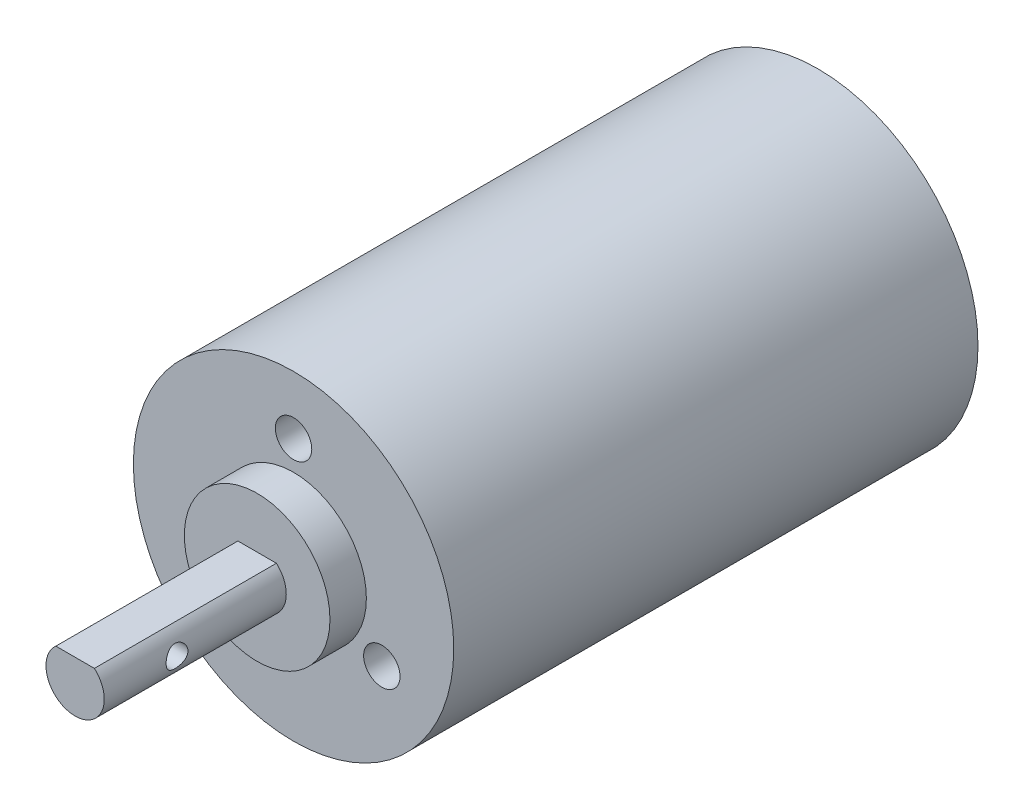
ISO-10303-21;
HEADER;
FILE_DESCRIPTION(('STEP AP214'),'2;1');
FILE_NAME('part.step','',(''),(''),'','','');
FILE_SCHEMA(('AUTOMOTIVE_DESIGN { 1 0 10303 214 1 1 1 1 }'));
ENDSEC;
DATA;
#1=APPLICATION_CONTEXT('core data for automotive mechanical design processes');
#2=APPLICATION_PROTOCOL_DEFINITION('international standard','automotive_design',2000,#1);
#3=PRODUCT_CONTEXT('',#1,'mechanical');
#4=PRODUCT('Part','Part','',(#3));
#5=PRODUCT_RELATED_PRODUCT_CATEGORY('part','',(#4));
#6=PRODUCT_DEFINITION_FORMATION('','',#4);
#7=PRODUCT_DEFINITION_CONTEXT('part definition',#1,'design');
#8=PRODUCT_DEFINITION('design','',#6,#7);
#9=PRODUCT_DEFINITION_SHAPE('','',#8);
#10=(LENGTH_UNIT() NAMED_UNIT(*) SI_UNIT(.MILLI.,.METRE.));
#11=(NAMED_UNIT(*) PLANE_ANGLE_UNIT() SI_UNIT($,.RADIAN.));
#12=(NAMED_UNIT(*) SI_UNIT($,.STERADIAN.) SOLID_ANGLE_UNIT());
#13=UNCERTAINTY_MEASURE_WITH_UNIT(LENGTH_MEASURE(1.E-05),#10,'distance_accuracy_value','');
#14=(GEOMETRIC_REPRESENTATION_CONTEXT(3) GLOBAL_UNCERTAINTY_ASSIGNED_CONTEXT((#13)) GLOBAL_UNIT_ASSIGNED_CONTEXT((#10,
#11,#12)) REPRESENTATION_CONTEXT('',''));
#15=CARTESIAN_POINT('',(0.,0.,0.));
#16=DIRECTION('',(0.,0.,1.));
#17=DIRECTION('',(1.,0.,0.));
#18=AXIS2_PLACEMENT_3D('',#15,#16,#17);
#19=CARTESIAN_POINT('',(0.,0.,0.));
#20=DIRECTION('',(0.,0.,1.));
#21=DIRECTION('',(1.,0.,0.));
#22=AXIS2_PLACEMENT_3D('',#19,#20,#21);
#23=PLANE('',#22);
#24=CARTESIAN_POINT('',(0.,0.,0.));
#25=DIRECTION('',(0.,0.,1.));
#26=DIRECTION('',(1.,0.,0.));
#27=AXIS2_PLACEMENT_3D('',#24,#25,#26);
#28=CIRCLE('',#27,11.);
#29=CARTESIAN_POINT('',(11.,0.,0.));
#30=VERTEX_POINT('',#29);
#31=EDGE_CURVE('E87',#30,#30,#28,.T.);
#32=ORIENTED_EDGE('',*,*,#31,.T.);
#33=EDGE_LOOP('',(#32));
#34=FACE_BOUND('',#33,.T.);
#35=CARTESIAN_POINT('',(0.,7.,0.));
#36=DIRECTION('',(0.,0.,1.));
#37=DIRECTION('',(1.,0.,0.));
#38=AXIS2_PLACEMENT_3D('',#35,#36,#37);
#39=CIRCLE('',#38,1.25);
#40=CARTESIAN_POINT('',(1.24999999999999,7.,0.));
#41=VERTEX_POINT('',#40);
#42=EDGE_CURVE('E181',#41,#41,#39,.T.);
#43=ORIENTED_EDGE('',*,*,#42,.F.);
#44=EDGE_LOOP('',(#43));
#45=FACE_BOUND('',#44,.T.);
#46=CARTESIAN_POINT('',(-6.06217782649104,-3.50000000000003,0.));
#47=DIRECTION('',(0.,0.,1.));
#48=DIRECTION('',(-0.500000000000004,0.866025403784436,0.));
#49=AXIS2_PLACEMENT_3D('',#46,#47,#48);
#50=CIRCLE('',#49,1.25);
#51=CARTESIAN_POINT('',(-6.68717782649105,-2.41746824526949,0.));
#52=VERTEX_POINT('',#51);
#53=EDGE_CURVE('E190',#52,#52,#50,.T.);
#54=ORIENTED_EDGE('',*,*,#53,.F.);
#55=EDGE_LOOP('',(#54));
#56=FACE_BOUND('',#55,.T.);
#57=CARTESIAN_POINT('',(6.0621778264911,-3.49999999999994,0.));
#58=DIRECTION('',(0.,0.,1.));
#59=DIRECTION('',(-0.499999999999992,-0.866025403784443,0.));
#60=AXIS2_PLACEMENT_3D('',#57,#58,#59);
#61=CIRCLE('',#60,1.25);
#62=CARTESIAN_POINT('',(5.43717782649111,-4.5825317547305,0.));
#63=VERTEX_POINT('',#62);
#64=EDGE_CURVE('E83',#63,#63,#61,.T.);
#65=ORIENTED_EDGE('',*,*,#64,.F.);
#66=EDGE_LOOP('',(#65));
#67=FACE_BOUND('',#66,.T.);
#68=CARTESIAN_POINT('',(0.,0.,0.));
#69=DIRECTION('',(0.,0.,1.));
#70=DIRECTION('',(1.,0.,0.));
#71=AXIS2_PLACEMENT_3D('',#68,#69,#70);
#72=CIRCLE('',#71,5.);
#73=CARTESIAN_POINT('',(5.,0.,0.));
#74=VERTEX_POINT('',#73);
#75=EDGE_CURVE('E200',#74,#74,#72,.T.);
#76=ORIENTED_EDGE('',*,*,#75,.F.);
#77=EDGE_LOOP('',(#76));
#78=FACE_BOUND('',#77,.T.);
#79=ADVANCED_FACE('F42',(#34,#45,#56,#67,#78),#23,.T.);
#80=CARTESIAN_POINT('',(0.,0.,-36.));
#81=DIRECTION('',(0.,0.,1.));
#82=DIRECTION('',(1.,0.,0.));
#83=AXIS2_PLACEMENT_3D('',#80,#81,#82);
#84=CYLINDRICAL_SURFACE('',#83,11.);
#85=CARTESIAN_POINT('',(0.,0.,-36.));
#86=DIRECTION('',(0.,0.,1.));
#87=DIRECTION('',(1.,0.,0.));
#88=AXIS2_PLACEMENT_3D('',#85,#86,#87);
#89=CIRCLE('',#88,11.);
#90=CARTESIAN_POINT('',(11.,0.,-36.));
#91=VERTEX_POINT('',#90);
#92=EDGE_CURVE('E55',#91,#91,#89,.T.);
#93=ORIENTED_EDGE('',*,*,#92,.T.);
#94=EDGE_LOOP('',(#93));
#95=FACE_BOUND('',#94,.T.);
#96=ORIENTED_EDGE('',*,*,#31,.F.);
#97=EDGE_LOOP('',(#96));
#98=FACE_BOUND('',#97,.T.);
#99=ADVANCED_FACE('F44',(#95,#98),#84,.T.);
#100=CARTESIAN_POINT('',(0.,0.,-36.));
#101=DIRECTION('',(0.,0.,1.));
#102=DIRECTION('',(1.,0.,0.));
#103=AXIS2_PLACEMENT_3D('',#100,#101,#102);
#104=PLANE('',#103);
#105=CARTESIAN_POINT('',(0.,0.,-36.));
#106=DIRECTION('',(0.,0.,-1.));
#107=DIRECTION('',(-1.,0.,0.));
#108=AXIS2_PLACEMENT_3D('',#105,#106,#107);
#109=CIRCLE('',#108,1.);
#110=CARTESIAN_POINT('',(-1.00000000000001,0.,-36.));
#111=VERTEX_POINT('',#110);
#112=EDGE_CURVE('E169',#111,#111,#109,.T.);
#113=ORIENTED_EDGE('',*,*,#112,.F.);
#114=EDGE_LOOP('',(#113));
#115=FACE_BOUND('',#114,.T.);
#116=ORIENTED_EDGE('',*,*,#92,.F.);
#117=EDGE_LOOP('',(#116));
#118=FACE_BOUND('',#117,.T.);
#119=ADVANCED_FACE('F147',(#115,#118),#104,.F.);
#120=CARTESIAN_POINT('',(0.,0.,-29.5));
#121=DIRECTION('',(0.,0.,-1.));
#122=DIRECTION('',(-1.,0.,0.));
#123=AXIS2_PLACEMENT_3D('',#120,#121,#122);
#124=CYLINDRICAL_SURFACE('',#123,1.);
#125=CARTESIAN_POINT('',(0.,0.,-29.5));
#126=DIRECTION('',(0.,0.,-1.));
#127=DIRECTION('',(-1.,0.,0.));
#128=AXIS2_PLACEMENT_3D('',#125,#126,#127);
#129=CIRCLE('',#128,1.);
#130=CARTESIAN_POINT('',(-1.00000000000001,0.,-29.5));
#131=VERTEX_POINT('',#130);
#132=EDGE_CURVE('E174',#131,#131,#129,.T.);
#133=CARTESIAN_POINT('',(-1.00000000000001,0.,-29.5));
#134=CARTESIAN_POINT('',(-1.00000000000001,0.,-29.5677083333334));
#135=CARTESIAN_POINT('',(-1.00000000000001,0.,-29.6354166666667));
#136=CARTESIAN_POINT('',(-1.00000000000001,0.,-29.7708333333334));
#137=CARTESIAN_POINT('',(-1.00000000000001,0.,-29.8385416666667));
#138=CARTESIAN_POINT('',(-1.00000000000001,0.,-29.9739583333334));
#139=CARTESIAN_POINT('',(-1.00000000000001,0.,-30.0416666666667));
#140=CARTESIAN_POINT('',(-1.00000000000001,0.,-30.1770833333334));
#141=CARTESIAN_POINT('',(-1.00000000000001,0.,-30.2447916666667));
#142=CARTESIAN_POINT('',(-1.00000000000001,0.,-30.3802083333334));
#143=CARTESIAN_POINT('',(-1.00000000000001,0.,-30.4479166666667));
#144=CARTESIAN_POINT('',(-1.00000000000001,0.,-30.5833333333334));
#145=CARTESIAN_POINT('',(-1.00000000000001,0.,-30.6510416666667));
#146=CARTESIAN_POINT('',(-1.00000000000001,0.,-30.7864583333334));
#147=CARTESIAN_POINT('',(-1.00000000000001,0.,-30.8541666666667));
#148=CARTESIAN_POINT('',(-1.00000000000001,0.,-30.9895833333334));
#149=CARTESIAN_POINT('',(-1.00000000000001,0.,-31.0572916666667));
#150=CARTESIAN_POINT('',(-1.00000000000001,0.,-31.1927083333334));
#151=CARTESIAN_POINT('',(-1.00000000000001,0.,-31.2604166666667));
#152=CARTESIAN_POINT('',(-1.00000000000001,0.,-31.3958333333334));
#153=CARTESIAN_POINT('',(-1.00000000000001,0.,-31.4635416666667));
#154=CARTESIAN_POINT('',(-1.00000000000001,0.,-31.5989583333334));
#155=CARTESIAN_POINT('',(-1.00000000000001,0.,-31.6666666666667));
#156=CARTESIAN_POINT('',(-1.00000000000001,0.,-31.8020833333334));
#157=CARTESIAN_POINT('',(-1.00000000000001,0.,-31.8697916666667));
#158=CARTESIAN_POINT('',(-1.00000000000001,0.,-32.0052083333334));
#159=CARTESIAN_POINT('',(-1.00000000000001,0.,-32.0729166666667));
#160=CARTESIAN_POINT('',(-1.00000000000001,0.,-32.2083333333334));
#161=CARTESIAN_POINT('',(-1.00000000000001,0.,-32.2760416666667));
#162=CARTESIAN_POINT('',(-1.00000000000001,0.,-32.4114583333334));
#163=CARTESIAN_POINT('',(-1.00000000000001,0.,-32.4791666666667));
#164=CARTESIAN_POINT('',(-1.00000000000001,0.,-32.6145833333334));
#165=CARTESIAN_POINT('',(-1.00000000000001,0.,-32.6822916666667));
#166=CARTESIAN_POINT('',(-1.00000000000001,0.,-32.8177083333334));
#167=CARTESIAN_POINT('',(-1.00000000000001,0.,-32.8854166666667));
#168=CARTESIAN_POINT('',(-1.00000000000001,0.,-33.0208333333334));
#169=CARTESIAN_POINT('',(-1.00000000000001,0.,-33.0885416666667));
#170=CARTESIAN_POINT('',(-1.00000000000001,0.,-33.2239583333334));
#171=CARTESIAN_POINT('',(-1.00000000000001,0.,-33.2916666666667));
#172=CARTESIAN_POINT('',(-1.00000000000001,0.,-33.4270833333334));
#173=CARTESIAN_POINT('',(-1.00000000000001,0.,-33.4947916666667));
#174=CARTESIAN_POINT('',(-1.00000000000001,0.,-33.6302083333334));
#175=CARTESIAN_POINT('',(-1.00000000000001,0.,-33.6979166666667));
#176=CARTESIAN_POINT('',(-1.00000000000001,0.,-33.8333333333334));
#177=CARTESIAN_POINT('',(-1.00000000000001,0.,-33.9010416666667));
#178=CARTESIAN_POINT('',(-1.00000000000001,0.,-34.0364583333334));
#179=CARTESIAN_POINT('',(-1.00000000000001,0.,-34.1041666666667));
#180=CARTESIAN_POINT('',(-1.00000000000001,0.,-34.2395833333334));
#181=CARTESIAN_POINT('',(-1.00000000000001,0.,-34.3072916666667));
#182=CARTESIAN_POINT('',(-1.00000000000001,0.,-34.4427083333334));
#183=CARTESIAN_POINT('',(-1.00000000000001,0.,-34.5104166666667));
#184=CARTESIAN_POINT('',(-1.00000000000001,0.,-34.6458333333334));
#185=CARTESIAN_POINT('',(-1.00000000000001,0.,-34.7135416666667));
#186=CARTESIAN_POINT('',(-1.00000000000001,0.,-34.8489583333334));
#187=CARTESIAN_POINT('',(-1.00000000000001,0.,-34.9166666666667));
#188=CARTESIAN_POINT('',(-1.00000000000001,0.,-35.0520833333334));
#189=CARTESIAN_POINT('',(-1.00000000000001,0.,-35.1197916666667));
#190=CARTESIAN_POINT('',(-1.00000000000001,0.,-35.2552083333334));
#191=CARTESIAN_POINT('',(-1.00000000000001,0.,-35.3229166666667));
#192=CARTESIAN_POINT('',(-1.00000000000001,0.,-35.4583333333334));
#193=CARTESIAN_POINT('',(-1.00000000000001,0.,-35.5260416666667));
#194=CARTESIAN_POINT('',(-1.00000000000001,0.,-35.6614583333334));
#195=CARTESIAN_POINT('',(-1.00000000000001,0.,-35.7291666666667));
#196=CARTESIAN_POINT('',(-1.00000000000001,0.,-35.8645833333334));
#197=CARTESIAN_POINT('',(-1.00000000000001,0.,-35.9322916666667));
#198=CARTESIAN_POINT('',(-1.00000000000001,0.,-36.));
#199=B_SPLINE_CURVE_WITH_KNOTS('',3,(#133,#134,#135,#136,#137,#138,#139,#140,#141,#142,#143,
#144,#145,#146,#147,#148,#149,#150,#151,#152,#153,#154,#155,#156,#157,#158,#159,#160,#161,#162,
#163,#164,#165,#166,#167,#168,#169,#170,#171,#172,#173,#174,#175,#176,#177,#178,#179,#180,#181,
#182,#183,#184,#185,#186,#187,#188,#189,#190,#191,#192,#193,#194,#195,#196,#197,#198),
.UNSPECIFIED.,.F.,.F.,(4,2,2,2,2,2,2,2,2,2,2,2,2,2,2,2,2,2,2,2,2,2,2,2,2,2,2,2,2,2,2,2,4),(0.,
0.203124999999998,0.406249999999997,0.609374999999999,0.812499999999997,1.015625,1.21875,
1.421875,1.625,1.828125,2.03125,2.234375,2.4375,2.640625,2.84375,3.046875,3.25,3.453125,3.65625,
3.859375,4.0625,4.265625,4.46875,4.671875,4.875,5.078125,5.28125,5.484375,5.6875,5.890625,
6.09375,6.296875,6.5),.UNSPECIFIED.);
#200=EDGE_CURVE('BSEAM143',#131,#111,#199,.T.);
#201=ORIENTED_EDGE('',*,*,#132,.F.);
#202=ORIENTED_EDGE('',*,*,#112,.T.);
#203=ORIENTED_EDGE('',*,*,#200,.T.);
#204=ORIENTED_EDGE('',*,*,#200,.F.);
#205=EDGE_LOOP('',(#201,#203,#202,#204));
#206=FACE_BOUND('',#205,.T.);
#207=ADVANCED_FACE('F143',(#206),#124,.F.);
#208=CARTESIAN_POINT('',(0.,0.,-29.5));
#209=DIRECTION('',(0.,0.,-1.));
#210=DIRECTION('',(-1.,0.,0.));
#211=AXIS2_PLACEMENT_3D('',#208,#209,#210);
#212=PLANE('',#211);
#213=ORIENTED_EDGE('',*,*,#132,.T.);
#214=EDGE_LOOP('',(#213));
#215=FACE_BOUND('',#214,.T.);
#216=ADVANCED_FACE('F139',(#215),#212,.T.);
#217=CARTESIAN_POINT('',(0.,7.,-4.));
#218=DIRECTION('',(0.,0.,1.));
#219=DIRECTION('',(1.,0.,0.));
#220=AXIS2_PLACEMENT_3D('',#217,#218,#219);
#221=CYLINDRICAL_SURFACE('',#220,1.25);
#222=CARTESIAN_POINT('',(0.,7.,-4.));
#223=DIRECTION('',(0.,0.,1.));
#224=DIRECTION('',(1.,0.,0.));
#225=AXIS2_PLACEMENT_3D('',#222,#223,#224);
#226=CIRCLE('',#225,1.25);
#227=CARTESIAN_POINT('',(1.24999999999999,7.,-4.));
#228=VERTEX_POINT('',#227);
#229=EDGE_CURVE('E175',#228,#228,#226,.T.);
#230=ORIENTED_EDGE('',*,*,#229,.F.);
#231=EDGE_LOOP('',(#230));
#232=FACE_BOUND('',#231,.T.);
#233=ORIENTED_EDGE('',*,*,#42,.T.);
#234=EDGE_LOOP('',(#233));
#235=FACE_BOUND('',#234,.T.);
#236=ADVANCED_FACE('F135',(#232,#235),#221,.F.);
#237=CARTESIAN_POINT('',(0.,7.,-4.));
#238=DIRECTION('',(0.,0.,1.));
#239=DIRECTION('',(1.,0.,0.));
#240=AXIS2_PLACEMENT_3D('',#237,#238,#239);
#241=PLANE('',#240);
#242=ORIENTED_EDGE('',*,*,#229,.T.);
#243=EDGE_LOOP('',(#242));
#244=FACE_BOUND('',#243,.T.);
#245=ADVANCED_FACE('F131',(#244),#241,.T.);
#246=CARTESIAN_POINT('',(-6.06217782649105,-3.50000000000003,-4.));
#247=DIRECTION('',(0.,0.,1.));
#248=DIRECTION('',(1.,0.,0.));
#249=AXIS2_PLACEMENT_3D('',#246,#247,#248);
#250=CYLINDRICAL_SURFACE('',#249,1.25);
#251=CARTESIAN_POINT('',(-6.06217782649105,-3.50000000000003,-4.));
#252=DIRECTION('',(0.,0.,1.));
#253=DIRECTION('',(-0.500000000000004,0.866025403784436,0.));
#254=AXIS2_PLACEMENT_3D('',#251,#252,#253);
#255=CIRCLE('',#254,1.25);
#256=CARTESIAN_POINT('',(-6.68717782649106,-2.41746824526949,-4.));
#257=VERTEX_POINT('',#256);
#258=EDGE_CURVE('E187',#257,#257,#255,.T.);
#259=ORIENTED_EDGE('',*,*,#258,.F.);
#260=EDGE_LOOP('',(#259));
#261=FACE_BOUND('',#260,.T.);
#262=ORIENTED_EDGE('',*,*,#53,.T.);
#263=EDGE_LOOP('',(#262));
#264=FACE_BOUND('',#263,.T.);
#265=ADVANCED_FACE('F127',(#261,#264),#250,.F.);
#266=CARTESIAN_POINT('',(-6.06217782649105,-3.50000000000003,-4.));
#267=DIRECTION('',(0.,0.,1.));
#268=DIRECTION('',(-0.500000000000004,0.866025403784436,0.));
#269=AXIS2_PLACEMENT_3D('',#266,#267,#268);
#270=PLANE('',#269);
#271=ORIENTED_EDGE('',*,*,#258,.T.);
#272=EDGE_LOOP('',(#271));
#273=FACE_BOUND('',#272,.T.);
#274=ADVANCED_FACE('F123',(#273),#270,.T.);
#275=CARTESIAN_POINT('',(6.0621778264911,-3.49999999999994,-4.));
#276=DIRECTION('',(0.,0.,1.));
#277=DIRECTION('',(1.,0.,0.));
#278=AXIS2_PLACEMENT_3D('',#275,#276,#277);
#279=CYLINDRICAL_SURFACE('',#278,1.25);
#280=CARTESIAN_POINT('',(6.0621778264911,-3.49999999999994,-4.));
#281=DIRECTION('',(0.,0.,1.));
#282=DIRECTION('',(-0.499999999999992,-0.866025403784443,0.));
#283=AXIS2_PLACEMENT_3D('',#280,#281,#282);
#284=CIRCLE('',#283,1.25);
#285=CARTESIAN_POINT('',(5.43717782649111,-4.58253175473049,-4.));
#286=VERTEX_POINT('',#285);
#287=EDGE_CURVE('E193',#286,#286,#284,.T.);
#288=ORIENTED_EDGE('',*,*,#287,.F.);
#289=EDGE_LOOP('',(#288));
#290=FACE_BOUND('',#289,.T.);
#291=ORIENTED_EDGE('',*,*,#64,.T.);
#292=EDGE_LOOP('',(#291));
#293=FACE_BOUND('',#292,.T.);
#294=ADVANCED_FACE('F119',(#290,#293),#279,.F.);
#295=CARTESIAN_POINT('',(6.0621778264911,-3.49999999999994,-4.));
#296=DIRECTION('',(0.,0.,1.));
#297=DIRECTION('',(-0.499999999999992,-0.866025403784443,0.));
#298=AXIS2_PLACEMENT_3D('',#295,#296,#297);
#299=PLANE('',#298);
#300=ORIENTED_EDGE('',*,*,#287,.T.);
#301=EDGE_LOOP('',(#300));
#302=FACE_BOUND('',#301,.T.);
#303=ADVANCED_FACE('F111',(#302),#299,.T.);
#304=CARTESIAN_POINT('',(0.,0.,2.5));
#305=DIRECTION('',(0.,0.,1.));
#306=DIRECTION('',(1.,0.,0.));
#307=AXIS2_PLACEMENT_3D('',#304,#305,#306);
#308=PLANE('',#307);
#309=CARTESIAN_POINT('',(0.,0.,2.5));
#310=DIRECTION('',(0.,0.,1.));
#311=DIRECTION('',(1.,0.,0.));
#312=AXIS2_PLACEMENT_3D('',#309,#310,#311);
#313=CIRCLE('',#312,5.);
#314=CARTESIAN_POINT('',(5.,0.,2.5));
#315=VERTEX_POINT('',#314);
#316=EDGE_CURVE('E84',#315,#315,#313,.T.);
#317=ORIENTED_EDGE('',*,*,#316,.T.);
#318=EDGE_LOOP('',(#317));
#319=FACE_BOUND('',#318,.T.);
#320=CARTESIAN_POINT('',(0.,0.,2.5));
#321=DIRECTION('',(0.,0.,1.));
#322=DIRECTION('',(1.,0.,0.));
#323=AXIS2_PLACEMENT_3D('',#320,#321,#322);
#324=CIRCLE('',#323,2.);
#325=CARTESIAN_POINT('',(-1.3228756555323,1.49999999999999,2.49999999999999));
#326=VERTEX_POINT('',#325);
#327=CARTESIAN_POINT('',(1.32287565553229,1.5,2.50000000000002));
#328=VERTEX_POINT('',#327);
#329=EDGE_CURVE('E62',#326,#328,#324,.T.);
#330=ORIENTED_EDGE('',*,*,#329,.F.);
#331=DIRECTION('',(-1.,0.,0.));
#332=VECTOR('',#331,1.);
#333=CARTESIAN_POINT('',(-1.3228756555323,1.49999999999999,2.49999999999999));
#334=LINE('',#333,#332);
#335=EDGE_CURVE('E11',#328,#326,#334,.T.);
#336=ORIENTED_EDGE('',*,*,#335,.F.);
#337=EDGE_LOOP('',(#330,#336));
#338=FACE_BOUND('',#337,.T.);
#339=ADVANCED_FACE('F73',(#319,#338),#308,.T.);
#340=CARTESIAN_POINT('',(0.,0.,2.5));
#341=DIRECTION('',(0.,0.,-1.));
#342=DIRECTION('',(-1.,0.,0.));
#343=AXIS2_PLACEMENT_3D('',#340,#341,#342);
#344=CYLINDRICAL_SURFACE('',#343,5.);
#345=ORIENTED_EDGE('',*,*,#316,.F.);
#346=EDGE_LOOP('',(#345));
#347=FACE_BOUND('',#346,.T.);
#348=ORIENTED_EDGE('',*,*,#75,.T.);
#349=EDGE_LOOP('',(#348));
#350=FACE_BOUND('',#349,.T.);
#351=ADVANCED_FACE('F110',(#347,#350),#344,.T.);
#352=CARTESIAN_POINT('',(0.,0.,15.));
#353=DIRECTION('',(0.,0.,1.));
#354=DIRECTION('',(1.,0.,0.));
#355=AXIS2_PLACEMENT_3D('',#352,#353,#354);
#356=PLANE('',#355);
#357=CARTESIAN_POINT('',(0.,0.,15.));
#358=DIRECTION('',(0.,0.,1.));
#359=DIRECTION('',(1.,0.,0.));
#360=AXIS2_PLACEMENT_3D('',#357,#358,#359);
#361=CIRCLE('',#360,2.);
#362=CARTESIAN_POINT('',(-1.3228756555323,1.5,15.));
#363=VERTEX_POINT('',#362);
#364=CARTESIAN_POINT('',(1.3228756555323,1.5,15.));
#365=VERTEX_POINT('',#364);
#366=EDGE_CURVE('E178',#363,#365,#361,.T.);
#367=ORIENTED_EDGE('',*,*,#366,.T.);
#368=DIRECTION('',(-1.,0.,0.));
#369=VECTOR('',#368,1.);
#370=CARTESIAN_POINT('',(-1.3228756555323,1.5,15.));
#371=LINE('',#370,#369);
#372=EDGE_CURVE('E68',#365,#363,#371,.T.);
#373=ORIENTED_EDGE('',*,*,#372,.T.);
#374=EDGE_LOOP('',(#367,#373));
#375=FACE_BOUND('',#374,.T.);
#376=ADVANCED_FACE('F115',(#375),#356,.T.);
#377=CARTESIAN_POINT('',(-1.3228756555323,1.5,15.));
#378=DIRECTION('',(0.,-1.,0.));
#379=DIRECTION('',(0.,0.,-1.));
#380=AXIS2_PLACEMENT_3D('',#377,#378,#379);
#381=PLANE('',#380);
#382=DIRECTION('',(0.,0.,-1.));
#383=VECTOR('',#382,1.);
#384=CARTESIAN_POINT('',(1.3228756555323,1.5,15.));
#385=LINE('',#384,#383);
#386=EDGE_CURVE('E81',#365,#328,#385,.T.);
#387=ORIENTED_EDGE('',*,*,#386,.T.);
#388=ORIENTED_EDGE('',*,*,#335,.T.);
#389=DIRECTION('',(0.,0.,-1.));
#390=VECTOR('',#389,1.);
#391=CARTESIAN_POINT('',(-1.3228756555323,1.5,15.));
#392=LINE('',#391,#390);
#393=EDGE_CURVE('E82',#363,#326,#392,.T.);
#394=ORIENTED_EDGE('',*,*,#393,.F.);
#395=ORIENTED_EDGE('',*,*,#372,.F.);
#396=EDGE_LOOP('',(#387,#388,#394,#395));
#397=FACE_BOUND('',#396,.T.);
#398=ADVANCED_FACE('F86',(#397),#381,.F.);
#399=CARTESIAN_POINT('',(0.,0.,15.));
#400=DIRECTION('',(0.,0.,-1.));
#401=DIRECTION('',(-1.,0.,0.));
#402=AXIS2_PLACEMENT_3D('',#399,#400,#401);
#403=CYLINDRICAL_SURFACE('',#402,2.);
#404=CARTESIAN_POINT('',(-2.00000000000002,0.,10.75));
#405=CARTESIAN_POINT('',(-2.00000108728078,-0.040617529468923,10.7500014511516));
#406=CARTESIAN_POINT('',(-1.9987518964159,-0.0812251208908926,10.7466901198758));
#407=CARTESIAN_POINT('',(-1.99389348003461,-0.16122672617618,10.733585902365));
#408=CARTESIAN_POINT('',(-1.99028459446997,-0.200620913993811,10.7237939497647));
#409=CARTESIAN_POINT('',(-1.98109416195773,-0.277030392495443,10.6981234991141));
#410=CARTESIAN_POINT('',(-1.97551642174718,-0.31405011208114,10.6822567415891));
#411=CARTESIAN_POINT('',(-1.96294383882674,-0.384899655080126,10.6449467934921));
#412=CARTESIAN_POINT('',(-1.95594861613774,-0.418728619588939,10.6235021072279));
#413=CARTESIAN_POINT('',(-1.94093123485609,-0.483673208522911,10.5746937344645));
#414=CARTESIAN_POINT('',(-1.93288001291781,-0.514635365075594,10.5471348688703));
#415=CARTESIAN_POINT('',(-1.91680110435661,-0.571622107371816,10.4872947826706));
#416=CARTESIAN_POINT('',(-1.90877342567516,-0.597645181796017,10.4550121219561));
#417=CARTESIAN_POINT('',(-1.89331235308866,-0.64499101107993,10.3851412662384));
#418=CARTESIAN_POINT('',(-1.88591324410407,-0.666096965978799,10.3473978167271));
#419=CARTESIAN_POINT('',(-1.87299930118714,-0.701593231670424,10.2685758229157));
#420=CARTESIAN_POINT('',(-1.8674837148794,-0.715986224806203,10.2274986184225));
#421=CARTESIAN_POINT('',(-1.85927206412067,-0.737042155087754,10.1449416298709));
#422=CARTESIAN_POINT('',(-1.85646962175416,-0.743997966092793,10.1035474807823));
#423=CARTESIAN_POINT('',(-1.85369030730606,-0.750897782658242,10.0200919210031));
#424=CARTESIAN_POINT('',(-1.85371226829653,-0.750844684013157,9.97803079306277));
#425=CARTESIAN_POINT('',(-1.85648755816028,-0.743952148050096,9.89711523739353));
#426=CARTESIAN_POINT('',(-1.85907734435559,-0.737519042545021,9.85821954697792));
#427=CARTESIAN_POINT('',(-1.86642469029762,-0.71872083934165,9.78210642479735));
#428=CARTESIAN_POINT('',(-1.87118257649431,-0.706354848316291,9.74488924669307));
#429=CARTESIAN_POINT('',(-1.88242851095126,-0.675818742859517,9.67236146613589));
#430=CARTESIAN_POINT('',(-1.88894758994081,-0.6575432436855,9.63710025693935));
#431=CARTESIAN_POINT('',(-1.90297105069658,-0.615780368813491,9.57002713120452));
#432=CARTESIAN_POINT('',(-1.9104757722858,-0.592291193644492,9.53821641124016));
#433=CARTESIAN_POINT('',(-1.92624019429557,-0.538908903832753,9.47669816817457));
#434=CARTESIAN_POINT('',(-1.93451673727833,-0.508691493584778,9.44727567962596));
#435=CARTESIAN_POINT('',(-1.9504586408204,-0.443656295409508,9.39383101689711));
#436=CARTESIAN_POINT('',(-1.95812390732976,-0.408837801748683,9.36980967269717));
#437=CARTESIAN_POINT('',(-1.9721319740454,-0.334861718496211,9.32753480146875));
#438=CARTESIAN_POINT('',(-1.97845249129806,-0.295645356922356,9.30937620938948));
#439=CARTESIAN_POINT('',(-1.98889359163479,-0.21441842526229,9.28000869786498));
#440=CARTESIAN_POINT('',(-1.99301515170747,-0.172409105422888,9.26879669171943));
#441=CARTESIAN_POINT('',(-1.99842221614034,-0.0891876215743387,9.25418860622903));
#442=CARTESIAN_POINT('',(-1.99984684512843,-0.0480518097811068,9.25040869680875));
#443=CARTESIAN_POINT('',(-2.00012946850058,0.0342862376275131,9.24965446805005));
#444=CARTESIAN_POINT('',(-1.99898803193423,0.0754884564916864,9.25267863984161));
#445=CARTESIAN_POINT('',(-1.99435854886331,0.155131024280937,9.26515502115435));
#446=CARTESIAN_POINT('',(-1.99096235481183,0.193616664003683,9.27435577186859));
#447=CARTESIAN_POINT('',(-1.98225738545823,0.26847087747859,9.29859303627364));
#448=CARTESIAN_POINT('',(-1.97694836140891,0.304839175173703,9.31363030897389));
#449=CARTESIAN_POINT('',(-1.96474812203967,0.375623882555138,9.34959320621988));
#450=CARTESIAN_POINT('',(-1.95781500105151,0.409951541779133,9.37067886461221));
#451=CARTESIAN_POINT('',(-1.9431333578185,0.474696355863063,9.41795905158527));
#452=CARTESIAN_POINT('',(-1.93538453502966,0.505112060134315,9.44415546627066));
#453=CARTESIAN_POINT('',(-1.91936664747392,0.563015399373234,9.50270206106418));
#454=CARTESIAN_POINT('',(-1.91109348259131,0.590230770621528,9.53532109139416));
#455=CARTESIAN_POINT('',(-1.89539407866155,0.638855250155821,9.60482569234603));
#456=CARTESIAN_POINT('',(-1.88796791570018,0.660263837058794,9.64171164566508));
#457=CARTESIAN_POINT('',(-1.87483414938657,0.696688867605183,9.71900799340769));
#458=CARTESIAN_POINT('',(-1.86913380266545,0.711678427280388,9.75943237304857));
#459=CARTESIAN_POINT('',(-1.86027016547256,0.734539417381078,9.84250488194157));
#460=CARTESIAN_POINT('',(-1.85710530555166,0.742415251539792,9.88515161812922));
#461=CARTESIAN_POINT('',(-1.85387947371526,0.750431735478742,9.96850807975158));
#462=CARTESIAN_POINT('',(-1.8536322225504,0.75103665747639,10.0091663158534));
#463=CARTESIAN_POINT('',(-1.8557920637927,0.745683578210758,10.0899726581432));
#464=CARTESIAN_POINT('',(-1.85819890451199,0.739726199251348,10.1301208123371));
#465=CARTESIAN_POINT('',(-1.86524070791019,0.721779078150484,10.207523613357));
#466=CARTESIAN_POINT('',(-1.86980542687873,0.709978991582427,10.2448291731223));
#467=CARTESIAN_POINT('',(-1.88060774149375,0.680848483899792,10.3169527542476));
#468=CARTESIAN_POINT('',(-1.88684575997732,0.663516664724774,10.3517701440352));
#469=CARTESIAN_POINT('',(-1.90069861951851,0.622760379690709,10.4199133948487));
#470=CARTESIAN_POINT('',(-1.90836849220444,0.599064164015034,10.4530653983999));
#471=CARTESIAN_POINT('',(-1.92403123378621,0.546672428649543,10.5150707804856));
#472=CARTESIAN_POINT('',(-1.93202420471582,0.517975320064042,10.5439227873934));
#473=CARTESIAN_POINT('',(-1.9479521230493,0.454540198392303,10.5981009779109));
#474=CARTESIAN_POINT('',(-1.95586052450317,0.419559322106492,10.6231518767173));
#475=CARTESIAN_POINT('',(-1.97027257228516,0.345606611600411,10.6670113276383));
#476=CARTESIAN_POINT('',(-1.9767761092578,0.306634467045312,10.6858193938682));
#477=CARTESIAN_POINT('',(-1.98787146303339,0.223999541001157,10.7171884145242));
#478=CARTESIAN_POINT('',(-1.99236828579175,0.180206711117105,10.729443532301));
#479=CARTESIAN_POINT('',(-1.99843121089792,0.0909378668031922,10.7458464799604));
#480=CARTESIAN_POINT('',(-1.99999878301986,0.0454627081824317,10.7499983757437));
#481=CARTESIAN_POINT('',(-2.00000000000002,0.,10.75));
#482=B_SPLINE_CURVE_WITH_KNOTS('',3,(#404,#405,#406,#407,#408,#409,#410,#411,#412,#413,#414,
#415,#416,#417,#418,#419,#420,#421,#422,#423,#424,#425,#426,#427,#428,#429,#430,#431,#432,#433,
#434,#435,#436,#437,#438,#439,#440,#441,#442,#443,#444,#445,#446,#447,#448,#449,#450,#451,#452,
#453,#454,#455,#456,#457,#458,#459,#460,#461,#462,#463,#464,#465,#466,#467,#468,#469,#470,#471,
#472,#473,#474,#475,#476,#477,#478,#479,#480,#481),.UNSPECIFIED.,.T.,.F.,(4,2,2,2,2,2,2,2,2,2,2,
2,2,2,2,2,2,2,2,2,2,2,2,2,2,2,2,2,2,2,2,2,2,2,2,2,2,2,4),(0.,0.121684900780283,
0.243352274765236,0.364785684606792,0.486251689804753,0.612368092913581,0.738523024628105,
0.869483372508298,1.00039134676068,1.12592937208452,1.25141553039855,1.36939172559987,
1.48738569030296,1.6076120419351,1.7278799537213,1.85623076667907,1.98460128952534,
2.11495687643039,2.24525449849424,2.36862509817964,2.49196834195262,2.61057218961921,
2.72919146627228,2.85129610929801,2.97344590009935,3.1026825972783,3.23193089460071,
3.36171533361,3.49141937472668,3.61279381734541,3.73415675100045,3.85181571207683,
3.96950443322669,4.09336235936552,4.21725970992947,4.34786164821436,4.47847374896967,
4.61474257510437,4.7509430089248),.UNSPECIFIED.);
#483=CARTESIAN_POINT('',(-2.00000000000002,0.,10.75));
#484=VERTEX_POINT('',#483);
#485=EDGE_CURVE('E46',#484,#484,#482,.T.);
#486=ORIENTED_EDGE('',*,*,#485,.T.);
#487=EDGE_LOOP('',(#486));
#488=FACE_BOUND('',#487,.T.);
#489=CARTESIAN_POINT('',(2.,0.,9.25000000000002));
#490=CARTESIAN_POINT('',(2.00000108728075,-0.0406175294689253,9.24999854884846));
#491=CARTESIAN_POINT('',(1.99875189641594,-0.081225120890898,9.2533098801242));
#492=CARTESIAN_POINT('',(1.99389348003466,-0.161226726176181,9.26641409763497));
#493=CARTESIAN_POINT('',(1.99028459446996,-0.200620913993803,9.2762060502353));
#494=CARTESIAN_POINT('',(1.98109416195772,-0.277030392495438,9.3018765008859));
#495=CARTESIAN_POINT('',(1.97551642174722,-0.314050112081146,9.31774325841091));
#496=CARTESIAN_POINT('',(1.96294383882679,-0.384899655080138,9.35505320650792));
#497=CARTESIAN_POINT('',(1.95594861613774,-0.418728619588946,9.37649789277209));
#498=CARTESIAN_POINT('',(1.94093123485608,-0.483673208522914,9.42530626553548));
#499=CARTESIAN_POINT('',(1.93288001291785,-0.514635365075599,9.45286513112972));
#500=CARTESIAN_POINT('',(1.91680110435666,-0.57162210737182,9.51270521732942));
#501=CARTESIAN_POINT('',(1.90877342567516,-0.597645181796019,9.54498787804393));
#502=CARTESIAN_POINT('',(1.89331235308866,-0.644991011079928,9.61485873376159));
#503=CARTESIAN_POINT('',(1.88591324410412,-0.666096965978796,9.6526021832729));
#504=CARTESIAN_POINT('',(1.87299930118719,-0.701593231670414,9.73142417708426));
#505=CARTESIAN_POINT('',(1.8674837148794,-0.715986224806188,9.77250138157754));
#506=CARTESIAN_POINT('',(1.85927206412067,-0.737042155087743,9.85505837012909));
#507=CARTESIAN_POINT('',(1.85646962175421,-0.743997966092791,9.89645251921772));
#508=CARTESIAN_POINT('',(1.8536903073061,-0.750897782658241,9.97990807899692));
#509=CARTESIAN_POINT('',(1.85371226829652,-0.750844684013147,10.0219692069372));
#510=CARTESIAN_POINT('',(1.85648755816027,-0.743952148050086,10.1028847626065));
#511=CARTESIAN_POINT('',(1.85907734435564,-0.737519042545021,10.1417804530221));
#512=CARTESIAN_POINT('',(1.86642469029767,-0.718720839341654,10.2178935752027));
#513=CARTESIAN_POINT('',(1.87118257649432,-0.706354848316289,10.2551107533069));
#514=CARTESIAN_POINT('',(1.88242851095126,-0.675818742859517,10.3276385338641));
#515=CARTESIAN_POINT('',(1.88894758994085,-0.657543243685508,10.3628997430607));
#516=CARTESIAN_POINT('',(1.90297105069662,-0.615780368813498,10.4299728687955));
#517=CARTESIAN_POINT('',(1.9104757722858,-0.59229119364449,10.4617835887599));
#518=CARTESIAN_POINT('',(1.92624019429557,-0.538908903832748,10.5233018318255));
#519=CARTESIAN_POINT('',(1.93451673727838,-0.508691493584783,10.5527243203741));
#520=CARTESIAN_POINT('',(1.95045864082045,-0.443656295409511,10.6061689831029));
#521=CARTESIAN_POINT('',(1.95812390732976,-0.408837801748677,10.6301903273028));
#522=CARTESIAN_POINT('',(1.9721319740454,-0.334861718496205,10.6724651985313));
#523=CARTESIAN_POINT('',(1.97845249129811,-0.29564535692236,10.6906237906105));
#524=CARTESIAN_POINT('',(1.98889359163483,-0.214418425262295,10.719991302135));
#525=CARTESIAN_POINT('',(1.99301515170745,-0.172409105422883,10.7312033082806));
#526=CARTESIAN_POINT('',(1.99842221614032,-0.0891876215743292,10.745811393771));
#527=CARTESIAN_POINT('',(1.99984684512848,-0.0480518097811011,10.7495913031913));
#528=CARTESIAN_POINT('',(2.00012946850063,0.0342862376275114,10.75034553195));
#529=CARTESIAN_POINT('',(1.99898803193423,0.0754884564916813,10.7473213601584));
#530=CARTESIAN_POINT('',(1.99435854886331,0.155131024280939,10.7348449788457));
#531=CARTESIAN_POINT('',(1.99096235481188,0.193616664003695,10.7256442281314));
#532=CARTESIAN_POINT('',(1.98225738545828,0.268470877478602,10.7014069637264));
#533=CARTESIAN_POINT('',(1.97694836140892,0.304839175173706,10.6863696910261));
#534=CARTESIAN_POINT('',(1.96474812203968,0.375623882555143,10.6504067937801));
#535=CARTESIAN_POINT('',(1.95781500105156,0.409951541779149,10.6293211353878));
#536=CARTESIAN_POINT('',(1.94313335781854,0.474696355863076,10.5820409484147));
#537=CARTESIAN_POINT('',(1.93538453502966,0.505112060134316,10.5558445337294));
#538=CARTESIAN_POINT('',(1.91936664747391,0.563015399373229,10.4972979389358));
#539=CARTESIAN_POINT('',(1.91109348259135,0.59023077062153,10.4646789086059));
#540=CARTESIAN_POINT('',(1.8953940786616,0.638855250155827,10.395174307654));
#541=CARTESIAN_POINT('',(1.88796791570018,0.660263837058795,10.3582883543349));
#542=CARTESIAN_POINT('',(1.87483414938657,0.696688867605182,10.2809920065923));
#543=CARTESIAN_POINT('',(1.8691338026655,0.711678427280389,10.2405676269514));
#544=CARTESIAN_POINT('',(1.86027016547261,0.734539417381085,10.1574951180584));
#545=CARTESIAN_POINT('',(1.85710530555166,0.742415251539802,10.1148483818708));
#546=CARTESIAN_POINT('',(1.85387947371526,0.750431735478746,10.0314919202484));
#547=CARTESIAN_POINT('',(1.85363222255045,0.751036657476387,9.99083368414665));
#548=CARTESIAN_POINT('',(1.85579206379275,0.74568357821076,9.91002734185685));
#549=CARTESIAN_POINT('',(1.85819890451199,0.739726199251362,9.86987918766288));
#550=CARTESIAN_POINT('',(1.86524070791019,0.721779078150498,9.79247638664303));
#551=CARTESIAN_POINT('',(1.86980542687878,0.709978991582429,9.75517082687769));
#552=CARTESIAN_POINT('',(1.8806077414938,0.680848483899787,9.68304724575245));
#553=CARTESIAN_POINT('',(1.88684575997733,0.663516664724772,9.64822985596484));
#554=CARTESIAN_POINT('',(1.90069861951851,0.622760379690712,9.58008660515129));
#555=CARTESIAN_POINT('',(1.90836849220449,0.599064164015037,9.54693460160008));
#556=CARTESIAN_POINT('',(1.92403123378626,0.546672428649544,9.48492921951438));
#557=CARTESIAN_POINT('',(1.93202420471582,0.517975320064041,9.45607721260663));
#558=CARTESIAN_POINT('',(1.9479521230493,0.454540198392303,9.4018990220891));
#559=CARTESIAN_POINT('',(1.95586052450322,0.419559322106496,9.37684812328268));
#560=CARTESIAN_POINT('',(1.9702725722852,0.345606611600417,9.33298867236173));
#561=CARTESIAN_POINT('',(1.9767761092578,0.306634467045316,9.31418060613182));
#562=CARTESIAN_POINT('',(1.98787146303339,0.223999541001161,9.28281158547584));
#563=CARTESIAN_POINT('',(1.9923682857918,0.180206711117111,9.27055646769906));
#564=CARTESIAN_POINT('',(1.99843121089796,0.0909378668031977,9.25415352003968));
#565=CARTESIAN_POINT('',(1.99999878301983,0.045462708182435,9.25000162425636));
#566=CARTESIAN_POINT('',(2.,0.,9.25000000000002));
#567=B_SPLINE_CURVE_WITH_KNOTS('',3,(#489,#490,#491,#492,#493,#494,#495,#496,#497,#498,#499,
#500,#501,#502,#503,#504,#505,#506,#507,#508,#509,#510,#511,#512,#513,#514,#515,#516,#517,#518,
#519,#520,#521,#522,#523,#524,#525,#526,#527,#528,#529,#530,#531,#532,#533,#534,#535,#536,#537,
#538,#539,#540,#541,#542,#543,#544,#545,#546,#547,#548,#549,#550,#551,#552,#553,#554,#555,#556,
#557,#558,#559,#560,#561,#562,#563,#564,#565,#566),.UNSPECIFIED.,.T.,.F.,(4,2,2,2,2,2,2,2,2,2,2,
2,2,2,2,2,2,2,2,2,2,2,2,2,2,2,2,2,2,2,2,2,2,2,2,2,2,2,4),(0.,0.121684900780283,
0.243352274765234,0.364785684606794,0.486251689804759,0.612368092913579,0.738523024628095,
0.869483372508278,1.00039134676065,1.1259293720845,1.25141553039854,1.36939172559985,
1.48738569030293,1.60761204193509,1.72787995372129,1.85623076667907,1.98460128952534,
2.11495687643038,2.24525449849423,2.36862509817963,2.49196834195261,2.61057218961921,
2.72919146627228,2.851296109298,2.97344590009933,3.10268259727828,3.2319308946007,
3.36171533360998,3.49141937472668,3.6127938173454,3.73415675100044,3.85181571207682,
3.96950443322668,4.0933623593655,4.21725970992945,4.34786164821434,4.47847374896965,
4.61474257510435,4.75094300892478),.UNSPECIFIED.);
#568=CARTESIAN_POINT('',(2.,0.,9.25000000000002));
#569=VERTEX_POINT('',#568);
#570=EDGE_CURVE('E95',#569,#569,#567,.T.);
#571=ORIENTED_EDGE('',*,*,#570,.T.);
#572=EDGE_LOOP('',(#571));
#573=FACE_BOUND('',#572,.T.);
#574=ORIENTED_EDGE('',*,*,#393,.T.);
#575=ORIENTED_EDGE('',*,*,#329,.T.);
#576=ORIENTED_EDGE('',*,*,#386,.F.);
#577=ORIENTED_EDGE('',*,*,#366,.F.);
#578=EDGE_LOOP('',(#574,#575,#576,#577));
#579=FACE_BOUND('',#578,.T.);
#580=ADVANCED_FACE('F79',(#488,#573,#579),#403,.T.);
#581=CARTESIAN_POINT('',(-11.,0.,10.));
#582=DIRECTION('',(1.,0.,0.));
#583=DIRECTION('',(0.,0.,-1.));
#584=AXIS2_PLACEMENT_3D('',#581,#582,#583);
#585=CYLINDRICAL_SURFACE('',#584,0.75);
#586=ORIENTED_EDGE('',*,*,#570,.F.);
#587=EDGE_LOOP('',(#586));
#588=FACE_BOUND('',#587,.T.);
#589=ORIENTED_EDGE('',*,*,#485,.F.);
#590=EDGE_LOOP('',(#589));
#591=FACE_BOUND('',#590,.T.);
#592=ADVANCED_FACE('F102',(#588,#591),#585,.F.);
#593=CLOSED_SHELL('',(#79,#99,#119,#207,#216,#236,#245,#265,#274,#294,#303,#339,#351,#376,#398,
#580,#592));
#594=MANIFOLD_SOLID_BREP('B2',#593);
#595=ADVANCED_BREP_SHAPE_REPRESENTATION('',(#18,#594),#14);
#596=SHAPE_DEFINITION_REPRESENTATION(#9,#595);
ENDSEC;
END-ISO-10303-21;
